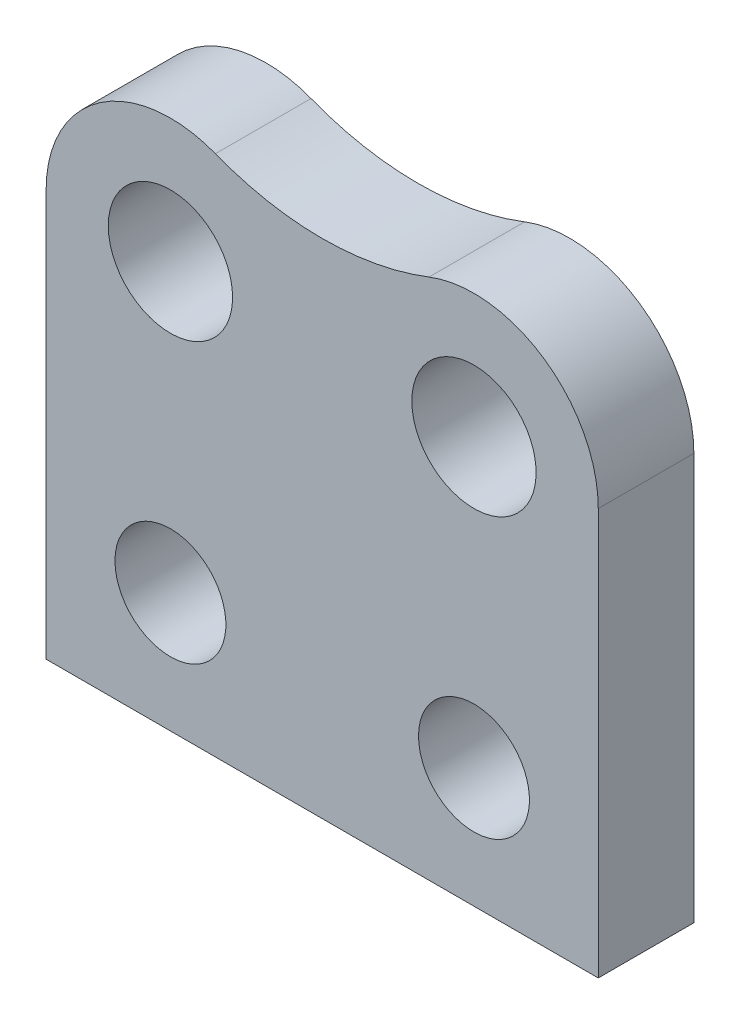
from build123d import *

# Parameters (mm, degrees)
BOSS_EXTRUDE1_DEPTH = 6.18
SKETCH2_R           = 2.1
CUT_EXTRUDE1_DEPTH  = 45.955560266
FILLET1_R           = 2
SKETCH3_R           = 1.16
BOSS_EXTRUDE2_DEPTH = 2
SKETCH5_W           = 46.23261583
SKETCH5_H           = 41.700006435
CUT_EXTRUDE2_DEPTH  = 6.18
SKETCH9_R           = 1.3
CUT_EXTRUDE3_DEPTH  = 39.857224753


with BuildPart() as part:
    # Sketch1 → Boss-Extrude1 (new body)
    with BuildSketch(Plane.XY):
        Polygon((0, 0), (0, 10), (7.5, 10), (12.499244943, 14.999244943), (12.499244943, 34.4), (24.749244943, 34.4), (24.749244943, 14.999244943), (29.748489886, 10), (37.248489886, 10), (37.248489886, 0), align=None)
    extrude(amount=BOSS_EXTRUDE1_DEPTH)

    # Sketch2 → Cut-Extrude1 (cut, through all)
    with BuildSketch(Plane(origin=(0, 10, 0), x_dir=(1, 0, 0), z_dir=(0, 1, 0))):
        with Locations(Location((3.75, -3.09, 0), (0, 0, 270))):
            Circle(SKETCH2_R)
        with Locations(Location((33.498489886, -3.09, 0), (0, 0, 270))):
            Circle(SKETCH2_R)
    extrude(amount=-CUT_EXTRUDE1_DEPTH, mode=Mode.SUBTRACT)

    # Fillet1
    fillet1_edges = [part.edges().sort_by_distance(p)[0] for p in [
        (0, 5, 0),
        (37.248489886, 5, 0),
        (12.499244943, 34.4, 3.09),
        (24.749244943, 34.4, 3.09),
        (0, 5, 6.18),
        (37.248489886, 5, 6.18),
    ]]
    fillet(fillet1_edges, radius=FILLET1_R)

    # Sketch3 → Boss-Extrude2 (add)
    # profile 1 of 15: a face of its own
    with BuildSketch(Plane(origin=(0, 0, 0), x_dir=(-1, 0, 0), z_dir=(0, 0, -1))):
        with BuildLine():
            Line((-14.76314253, 29.959470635), (-15.91314253, 29.959470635))
            ThreePointArc((-15.91314253, 29.959470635), (-18.51314253, 27.359470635), (-21.11314253, 29.959470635))
            Line((-21.11314253, 29.959470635), (-21.11314253, 21.454771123))
            Line((-21.11314253, 21.454771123), (-12.499244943, 21.454771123))
            Line((-12.499244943, 21.454771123), (-12.499244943, 22.849229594))
            ThreePointArc((-12.499244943, 22.849229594), (-13.32314253, 23.959470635), (-12.499244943, 25.069711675))
            Line((-12.499244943, 25.069711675), (-12.499244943, 27.381286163))
            ThreePointArc((-12.499244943, 27.381286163), (-14.116839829, 28.243933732), (-14.76314253, 29.959470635))
        make_face()
        with Locations((-18.51314253, 23.959470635)):
            Circle(SKETCH3_R, mode=Mode.SUBTRACT)
    # profile 2 of 15: a face of its own
    with BuildSketch(Plane(origin=(0, 0, 0), x_dir=(-1, 0, 0), z_dir=(0, 0, -1))):
        with BuildLine():
            ThreePointArc((-9.56314253, 29.959470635), (-10.447605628, 28.005773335), (-12.499244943, 27.381286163))
            Line((-12.499244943, 27.381286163), (-12.499244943, 25.069711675))
            ThreePointArc((-12.499244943, 25.069711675), (-11.47186791, 24.890995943), (-11.00314253, 23.959470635))
            ThreePointArc((-11.00314253, 23.959470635), (-11.47186791, 23.027945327), (-12.499244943, 22.849229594))
            Line((-12.499244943, 22.849229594), (-12.499244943, 21.454771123))
            Line((-12.499244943, 21.454771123), (-9.56314253, 21.454771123))
            Line((-9.56314253, 21.454771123), (-9.56314253, 29.959470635))
        make_face()
    # profile 3 of 15: a face of its own
    with BuildSketch(Plane(origin=(0, 0, 0), x_dir=(-1, 0, 0), z_dir=(0, 0, -1))):
        with BuildLine():
            Line((-13.31814253, 29.959470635), (-14.76314253, 29.959470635))
            ThreePointArc((-14.76314253, 29.959470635), (-14.116839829, 28.243933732), (-12.499244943, 27.381286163))
            Line((-12.499244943, 27.381286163), (-12.499244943, 28.854454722))
            ThreePointArc((-12.499244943, 28.854454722), (-13.091103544, 29.271783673), (-13.31814253, 29.959470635))
        make_face()
    # profile 4 of 15: a face of its own
    with BuildSketch(Plane(origin=(0, 0, 0), x_dir=(-1, 0, 0), z_dir=(0, 0, -1))):
        with BuildLine():
            Line((-12.499244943, 28.854454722), (-12.499244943, 27.381286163))
            ThreePointArc((-12.499244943, 27.381286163), (-10.447605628, 28.005773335), (-9.56314253, 29.959470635))
            Line((-9.56314253, 29.959470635), (-11.00814253, 29.959470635))
            ThreePointArc((-11.00814253, 29.959470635), (-11.475455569, 29.031509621), (-12.499244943, 28.854454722))
        make_face()
    # profile 5 of 15: a face of its own
    with BuildSketch(Plane(origin=(0, 0, 0), x_dir=(-1, 0, 0), z_dir=(0, 0, -1))):
        with BuildLine():
            Line((-13.31814253, 29.959470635), (-14.76314253, 29.959470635))
            ThreePointArc((-14.76314253, 29.959470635), (-14.116839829, 28.243933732), (-12.499244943, 27.381286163))
            Line((-12.499244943, 27.381286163), (-12.499244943, 28.854454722))
            ThreePointArc((-12.499244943, 28.854454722), (-13.091103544, 29.271783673), (-13.31814253, 29.959470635))
        make_face()
    # profile 6 of 15: a face of its own
    with BuildSketch(Plane(origin=(0, 0, 0), x_dir=(-1, 0, 0), z_dir=(0, 0, -1))):
        with BuildLine():
            Line((-12.499244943, 28.854454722), (-12.499244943, 27.381286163))
            ThreePointArc((-12.499244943, 27.381286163), (-10.447605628, 28.005773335), (-9.56314253, 29.959470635))
            Line((-9.56314253, 29.959470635), (-11.00814253, 29.959470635))
            ThreePointArc((-11.00814253, 29.959470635), (-11.475455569, 29.031509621), (-12.499244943, 28.854454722))
        make_face()
    # profile 7 of 15: a face of its own
    with BuildSketch(Plane(origin=(0, 0, 0), x_dir=(-1, 0, 0), z_dir=(0, 0, -1))):
        with BuildLine():
            ThreePointArc((-13.104419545, 32.383103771), (-14.308756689, 31.427918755), (-14.76314253, 29.959470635))
            Line((-14.76314253, 29.959470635), (-13.31814253, 29.959470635))
            ThreePointArc((-13.31814253, 29.959470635), (-13.091103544, 30.647157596), (-12.499244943, 31.064486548))
            Line((-12.499244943, 31.064486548), (-12.499244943, 32.4))
            ThreePointArc((-12.499244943, 32.4), (-12.500420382, 32.468559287), (-12.503945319, 32.537037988))
            ThreePointArc((-12.503945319, 32.537037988), (-12.808786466, 32.478030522), (-13.104419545, 32.383103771))
        make_face()
    # profile 8 of 15: a face of its own
    with BuildSketch(Plane(origin=(0, 0, 0), x_dir=(-1, 0, 0), z_dir=(0, 0, -1))):
        with BuildLine():
            Line((-12.499244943, 32.4), (-12.499244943, 31.064486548))
            ThreePointArc((-12.499244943, 31.064486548), (-11.475455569, 30.887431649), (-11.00814253, 29.959470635))
            Line((-11.00814253, 29.959470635), (-9.56314253, 29.959470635))
            ThreePointArc((-9.56314253, 29.959470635), (-10.449387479, 31.914731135), (-12.503945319, 32.537037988))
            ThreePointArc((-12.503945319, 32.537037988), (-12.500420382, 32.468559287), (-12.499244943, 32.4))
        make_face()
    # profile 9 of 15: a face of its own
    with BuildSketch(Plane(origin=(0, 0, 0), x_dir=(-1, 0, 0), z_dir=(0, 0, -1))):
        with BuildLine():
            ThreePointArc((-13.104419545, 32.383103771), (-14.308756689, 31.427918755), (-14.76314253, 29.959470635))
            Line((-14.76314253, 29.959470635), (-13.31814253, 29.959470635))
            ThreePointArc((-13.31814253, 29.959470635), (-13.091103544, 30.647157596), (-12.499244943, 31.064486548))
            Line((-12.499244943, 31.064486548), (-12.499244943, 32.4))
            ThreePointArc((-12.499244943, 32.4), (-12.500420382, 32.468559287), (-12.503945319, 32.537037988))
            ThreePointArc((-12.503945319, 32.537037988), (-12.808786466, 32.478030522), (-13.104419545, 32.383103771))
        make_face()
    # profile 10 of 15: a face of its own
    with BuildSketch(Plane(origin=(0, 0, 0), x_dir=(-1, 0, 0), z_dir=(0, 0, -1))):
        with BuildLine():
            Line((-12.499244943, 32.4), (-12.499244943, 31.064486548))
            ThreePointArc((-12.499244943, 31.064486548), (-11.475455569, 30.887431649), (-11.00814253, 29.959470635))
            Line((-11.00814253, 29.959470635), (-9.56314253, 29.959470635))
            ThreePointArc((-9.56314253, 29.959470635), (-10.449387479, 31.914731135), (-12.503945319, 32.537037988))
            ThreePointArc((-12.503945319, 32.537037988), (-12.500420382, 32.468559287), (-12.499244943, 32.4))
        make_face()
    # profile 11 of 15: a face of its own
    with BuildSketch(Plane(origin=(0, 0, 0), x_dir=(-1, 0, 0), z_dir=(0, 0, -1))):
        with BuildLine():
            ThreePointArc((-19.66814253, 29.959470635), (-18.51314253, 31.114470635), (-17.35814253, 29.959470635))
            Line((-17.35814253, 29.959470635), (-15.91314253, 29.959470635))
            ThreePointArc((-15.91314253, 29.959470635), (-16.367528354, 31.42791873), (-17.571865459, 32.38310375))
            ThreePointArc((-17.571865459, 32.38310375), (-19.981590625, 32.105084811), (-21.11314253, 29.959470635))
            Line((-21.11314253, 29.959470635), (-19.66814253, 29.959470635))
        make_face()
    # profile 12 of 15: a face of its own
    with BuildSketch(Plane(origin=(0, 0, 0), x_dir=(-1, 0, 0), z_dir=(0, 0, -1))):
        with BuildLine():
            Line((-15.91314253, 29.959470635), (-17.35814253, 29.959470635))
            ThreePointArc((-17.35814253, 29.959470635), (-18.51314253, 28.804470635), (-19.66814253, 29.959470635))
            Line((-19.66814253, 29.959470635), (-21.11314253, 29.959470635))
            ThreePointArc((-21.11314253, 29.959470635), (-18.51314253, 27.359470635), (-15.91314253, 29.959470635))
        make_face()
    # profile 13 of 15: a face of its own
    with BuildSketch(Plane(origin=(0, 0, 0), x_dir=(-1, 0, 0), z_dir=(0, 0, -1))):
        with BuildLine():
            ThreePointArc((-19.66814253, 29.959470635), (-18.51314253, 31.114470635), (-17.35814253, 29.959470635))
            Line((-17.35814253, 29.959470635), (-15.91314253, 29.959470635))
            ThreePointArc((-15.91314253, 29.959470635), (-16.367528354, 31.42791873), (-17.571865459, 32.38310375))
            ThreePointArc((-17.571865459, 32.38310375), (-19.981590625, 32.105084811), (-21.11314253, 29.959470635))
            Line((-21.11314253, 29.959470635), (-19.66814253, 29.959470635))
        make_face()
    # profile 14 of 15: a face of its own
    with BuildSketch(Plane(origin=(0, 0, 0), x_dir=(-1, 0, 0), z_dir=(0, 0, -1))):
        with BuildLine():
            Line((-15.91314253, 29.959470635), (-17.35814253, 29.959470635))
            ThreePointArc((-17.35814253, 29.959470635), (-18.51314253, 28.804470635), (-19.66814253, 29.959470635))
            Line((-19.66814253, 29.959470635), (-21.11314253, 29.959470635))
            ThreePointArc((-21.11314253, 29.959470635), (-18.51314253, 27.359470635), (-15.91314253, 29.959470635))
        make_face()
    # profile 15 of 15: a face of its own
    with BuildSketch(Plane(origin=(0, 0, 0), x_dir=(-1, 0, 0), z_dir=(0, 0, -1))):
        with BuildLine():
            ThreePointArc((-17.571865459, 32.38310375), (-16.367528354, 31.42791873), (-15.91314253, 29.959470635))
            Line((-15.91314253, 29.959470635), (-14.76314253, 29.959470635))
            ThreePointArc((-14.76314253, 29.959470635), (-14.308756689, 31.427918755), (-13.104419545, 32.383103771))
            ThreePointArc((-13.104419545, 32.383103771), (-15.3381425, 31.964571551), (-17.571865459, 32.38310375))
        make_face()
    extrude(amount=BOSS_EXTRUDE2_DEPTH)

    # Sketch5 → Cut-Extrude2 (cut)
    with BuildSketch(Plane.XY.offset(6.18)):
        with Locations((18.136117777, 17.095401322)):
            Rectangle(SKETCH5_W, SKETCH5_H)
    extrude(amount=-CUT_EXTRUDE2_DEPTH, mode=Mode.SUBTRACT)

    # Sketch9 → Cut-Extrude3 (cut, through all)
    with BuildSketch(Plane(origin=(0, 0, -2), x_dir=(-1, 0, 0), z_dir=(0, 0, -1))):
        with Locations((-18.51314253, 29.959470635)):
            Circle(SKETCH9_R)
        with Locations((-12.16314253, 29.959470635)):
            Circle(SKETCH9_R)
    extrude(amount=-CUT_EXTRUDE3_DEPTH, mode=Mode.SUBTRACT)


solid = part.part
